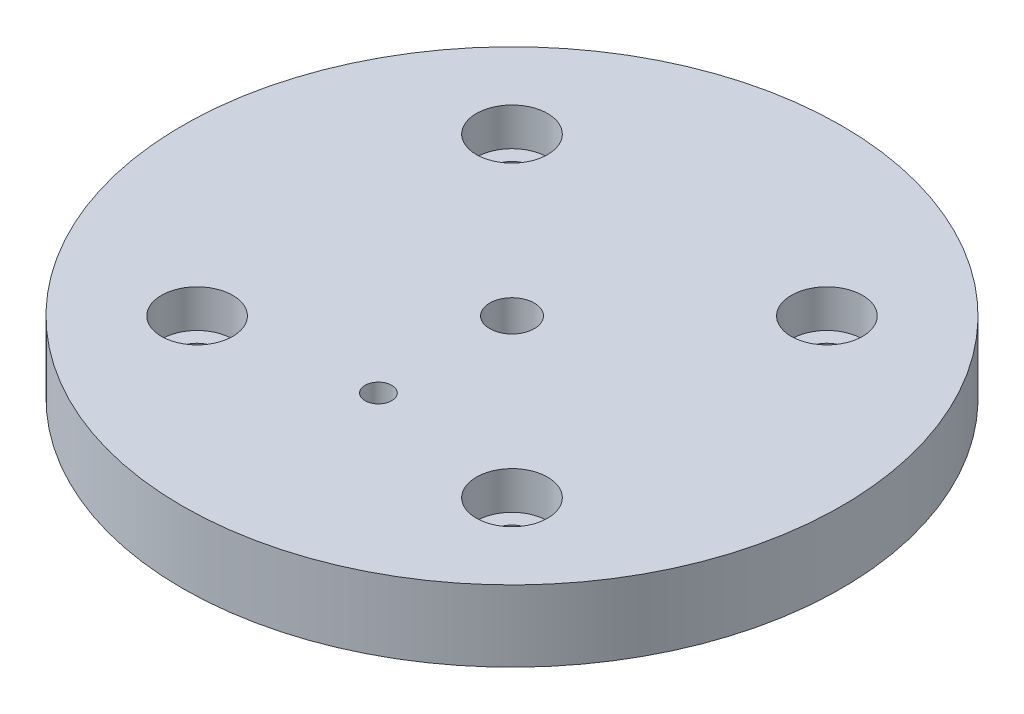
from build123d import *

# Parameters (mm, degrees)
SKETCH2_R                      = 37
BOSS_EXTRUDE2_DEPTH            = 8
CBORE_FOR_M4_SHCS1_D           = 4.5
CBORE_FOR_M4_SHCS1_CBORE_D     = 8
CBORE_FOR_M4_SHCS1_CBORE_DEPTH = 4.25
M6X1_0_TAPPED_HOLE1_D          = 5
F_3_0MM_DOWEL_HOLE1_D          = 3
F_3_0MM_DOWEL_HOLE1_DEPTH      = 3
F_3_0MM_DOWEL_HOLE1_TIP        = 0.901290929


with BuildPart() as part:
    # Sketch2 → Boss-Extrude2 (new body)
    with BuildSketch(Plane(origin=(0, 0, 0), x_dir=(1, 0, 0), z_dir=(0, 1, 0))):
        with Locations(Location((0, 0, 0), (0, 0, 270))):
            Circle(SKETCH2_R)
    extrude(amount=BOSS_EXTRUDE2_DEPTH)

    # CBORE for M4 SHCS1 (through all)
    with Locations(Plane(origin=(0, 8, 0), x_dir=(1, 0, 0), z_dir=(0, 1, 0))):
        with Locations((-17.67766953, 17.67766953), (17.67766953, 17.67766953), (-17.67766953, -17.67766953), (17.67766953, -17.67766953)):
            CounterBoreHole(CBORE_FOR_M4_SHCS1_D / 2, CBORE_FOR_M4_SHCS1_CBORE_D / 2, CBORE_FOR_M4_SHCS1_CBORE_DEPTH)

    # M6x1.0 Tapped Hole1 (through all)
    with Locations(Plane(origin=(0, 8, 0), x_dir=(1, 0, 0), z_dir=(0, 1, 0))):
        with Locations((0, 0)):
            Hole(M6X1_0_TAPPED_HOLE1_D / 2)

    # 3.0mm Dowel Hole1
    with Locations(Plane(origin=(0, 8, 0), x_dir=(1, 0, 0), z_dir=(0, 1, 0))):
        with Locations((0, -15)):
            Hole(F_3_0MM_DOWEL_HOLE1_D / 2, depth=F_3_0MM_DOWEL_HOLE1_DEPTH)
            with Locations((0, 0, -(F_3_0MM_DOWEL_HOLE1_DEPTH + F_3_0MM_DOWEL_HOLE1_TIP / 2))):  # 118° drill point
                Cone(0, F_3_0MM_DOWEL_HOLE1_D / 2, F_3_0MM_DOWEL_HOLE1_TIP, mode=Mode.SUBTRACT)


solid = part.part
